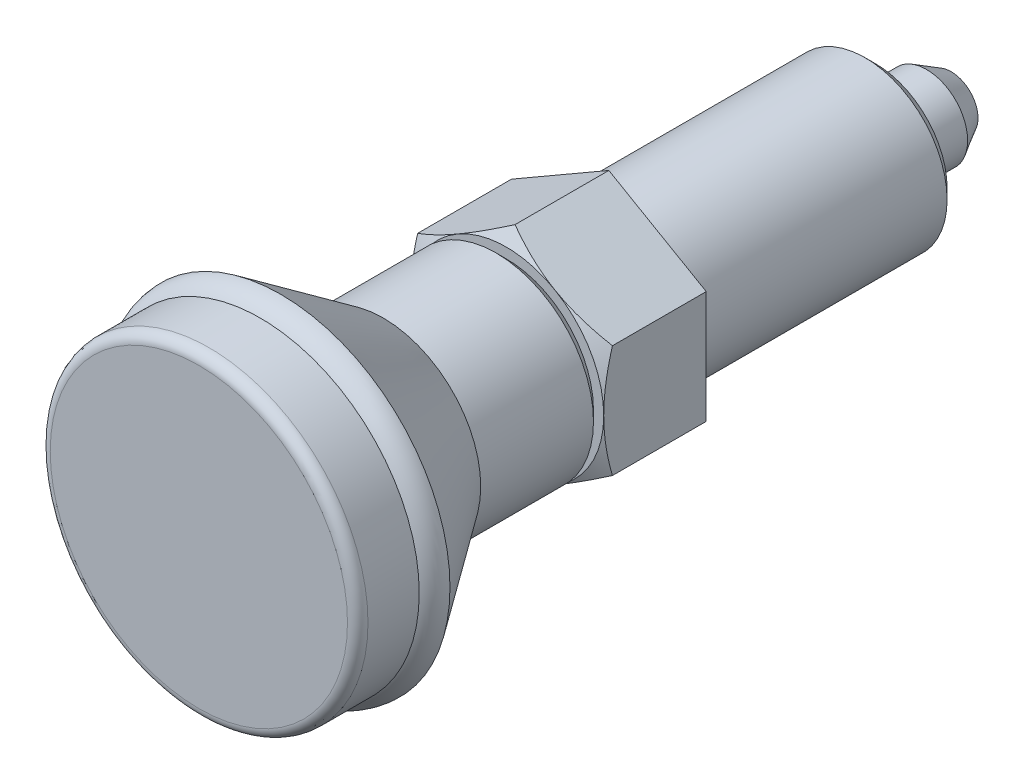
ISO-10303-21;
HEADER;
FILE_DESCRIPTION(('STEP AP214'),'2;1');
FILE_NAME('part.step','',(''),(''),'','','');
FILE_SCHEMA(('AUTOMOTIVE_DESIGN { 1 0 10303 214 1 1 1 1 }'));
ENDSEC;
DATA;
#1=APPLICATION_CONTEXT('core data for automotive mechanical design processes');
#2=APPLICATION_PROTOCOL_DEFINITION('international standard','automotive_design',2000,#1);
#3=PRODUCT_CONTEXT('',#1,'mechanical');
#4=PRODUCT('Part','Part','',(#3));
#5=PRODUCT_RELATED_PRODUCT_CATEGORY('part','',(#4));
#6=PRODUCT_DEFINITION_FORMATION('','',#4);
#7=PRODUCT_DEFINITION_CONTEXT('part definition',#1,'design');
#8=PRODUCT_DEFINITION('design','',#6,#7);
#9=PRODUCT_DEFINITION_SHAPE('','',#8);
#10=(LENGTH_UNIT() NAMED_UNIT(*) SI_UNIT(.MILLI.,.METRE.));
#11=(NAMED_UNIT(*) PLANE_ANGLE_UNIT() SI_UNIT($,.RADIAN.));
#12=(NAMED_UNIT(*) SI_UNIT($,.STERADIAN.) SOLID_ANGLE_UNIT());
#13=UNCERTAINTY_MEASURE_WITH_UNIT(LENGTH_MEASURE(1.E-05),#10,'distance_accuracy_value','');
#14=(GEOMETRIC_REPRESENTATION_CONTEXT(3) GLOBAL_UNCERTAINTY_ASSIGNED_CONTEXT((#13)) GLOBAL_UNIT_ASSIGNED_CONTEXT((#10,
#11,#12)) REPRESENTATION_CONTEXT('',''));
#15=CARTESIAN_POINT('',(0.,0.,0.));
#16=DIRECTION('',(0.,0.,1.));
#17=DIRECTION('',(1.,0.,0.));
#18=AXIS2_PLACEMENT_3D('',#15,#16,#17);
#19=CARTESIAN_POINT('',(-1.68952183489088E-08,9.75446155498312E-09,10.));
#20=DIRECTION('',(1.68952183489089E-09,-9.75446155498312E-10,-1.));
#21=DIRECTION('',(-1.,0.,-1.68952183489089E-09));
#22=AXIS2_PLACEMENT_3D('',#19,#20,#21);
#23=CONICAL_SURFACE('',#22,9.5,1.0471975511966);
#24=CARTESIAN_POINT('',(9.50019998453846,5.48471209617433,9.15142756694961));
#25=CARTESIAN_POINT('',(9.29136921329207,5.60528059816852,9.22102657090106));
#26=CARTESIAN_POINT('',(9.08175981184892,5.72629864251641,9.28746670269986));
#27=CARTESIAN_POINT('',(8.66086009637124,5.96930520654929,9.41315272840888));
#28=CARTESIAN_POINT('',(8.4495692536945,6.09129403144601,9.47239625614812));
#29=CARTESIAN_POINT('',(7.81229218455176,6.45922611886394,9.63818543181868));
#30=CARTESIAN_POINT('',(7.38379021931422,6.70662184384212,9.73248556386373));
#31=CARTESIAN_POINT('',(6.74255664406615,7.07683822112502,9.84306129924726));
#32=CARTESIAN_POINT('',(6.53174076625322,7.19855282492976,9.87456017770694));
#33=CARTESIAN_POINT('',(6.10913294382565,7.44254556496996,9.92738180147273));
#34=CARTESIAN_POINT('',(5.8973409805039,7.56482371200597,9.94870435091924));
#35=CARTESIAN_POINT('',(5.47340376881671,7.80958397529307,9.98062698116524));
#36=CARTESIAN_POINT('',(5.26125924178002,7.93206567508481,9.99123980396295));
#37=CARTESIAN_POINT('',(4.83677422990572,8.17714221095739,10.0015174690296));
#38=CARTESIAN_POINT('',(4.62443375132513,8.29973704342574,10.0011826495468));
#39=CARTESIAN_POINT('',(4.22745799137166,8.52893110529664,9.9903266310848));
#40=CARTESIAN_POINT('',(4.04279469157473,8.63554651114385,9.9811297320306));
#41=CARTESIAN_POINT('',(3.67389998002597,8.84852797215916,9.95463460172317));
#42=CARTESIAN_POINT('',(3.48966859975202,8.9548940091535,9.93733579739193));
#43=CARTESIAN_POINT('',(2.93768831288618,9.27357997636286,9.87369551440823));
#44=CARTESIAN_POINT('',(2.57091645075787,9.48533580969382,9.81561809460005));
#45=CARTESIAN_POINT('',(1.83348215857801,9.91109369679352,9.67042397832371));
#46=CARTESIAN_POINT('',(1.46291384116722,10.1250414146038,9.58269182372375));
#47=CARTESIAN_POINT('',(0.727303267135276,10.5497463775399,9.3835762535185));
#48=CARTESIAN_POINT('',(0.362251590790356,10.7605090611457,9.27223960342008));
#49=CARTESIAN_POINT('',(-0.000200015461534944,10.9697705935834,9.15142754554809));
#50=B_SPLINE_CURVE_WITH_KNOTS('',3,(#24,#25,#26,#27,#28,#29,#30,#31,#32,#33,#34,#35,#36,#37,#38,
#39,#40,#41,#42,#43,#44,#45,#46,#47,#48,#49),.UNSPECIFIED.,.F.,.F.,(4,2,2,2,2,2,2,2,2,2,2,2,4),
(0.,0.752880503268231,1.50600787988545,3.01546870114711,3.75167336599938,4.48789219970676,
5.22323407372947,5.95855322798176,6.59868084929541,7.23885375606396,8.52010929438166,
9.82978009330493,11.1368800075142),.UNSPECIFIED.);
#51=CARTESIAN_POINT('',(4.74999998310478,8.22724134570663,10.));
#52=VERTEX_POINT('',#51);
#53=CARTESIAN_POINT('',(0.,10.9696551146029,9.15149421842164));
#54=VERTEX_POINT('',#53);
#55=EDGE_CURVE('E99',#52,#54,#50,.T.);
#56=ORIENTED_EDGE('',*,*,#55,.T.);
#57=CARTESIAN_POINT('',(0.000199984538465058,10.9697705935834,9.15142754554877));
#58=CARTESIAN_POINT('',(-0.208630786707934,10.8492020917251,9.22102654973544));
#59=CARTESIAN_POINT('',(-0.418240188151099,10.7281840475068,9.28746668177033));
#60=CARTESIAN_POINT('',(-0.839139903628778,10.4851774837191,9.41315270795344));
#61=CARTESIAN_POINT('',(-1.05043074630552,10.363188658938,9.47239623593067));
#62=CARTESIAN_POINT('',(-1.68770781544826,9.99525657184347,9.63818541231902));
#63=CARTESIAN_POINT('',(-2.11620978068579,9.74786084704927,9.73248554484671));
#64=CARTESIAN_POINT('',(-2.75744335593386,9.37764446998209,9.8430612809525));
#65=CARTESIAN_POINT('',(-2.96825923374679,9.2559298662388,9.87456015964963));
#66=CARTESIAN_POINT('',(-3.39086705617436,9.01193712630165,9.92738178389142));
#67=CARTESIAN_POINT('',(-3.60265901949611,8.88965897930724,9.94870433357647));
#68=CARTESIAN_POINT('',(-4.0265962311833,8.64489871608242,9.98062696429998));
#69=CARTESIAN_POINT('',(-4.23874075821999,8.52241701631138,9.99123978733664));
#70=CARTESIAN_POINT('',(-4.66322577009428,8.27734048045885,10.0015174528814));
#71=CARTESIAN_POINT('',(-4.87556624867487,8.15474564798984,10.0011826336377));
#72=CARTESIAN_POINT('',(-5.27254200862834,7.92555158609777,9.9903266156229));
#73=CARTESIAN_POINT('',(-5.45720530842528,7.81893618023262,9.98112971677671));
#74=CARTESIAN_POINT('',(-5.82610001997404,7.60595471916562,9.95463458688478));
#75=CARTESIAN_POINT('',(-6.010331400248,7.49958868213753,9.93733578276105));
#76=CARTESIAN_POINT('',(-6.56231168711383,7.18090271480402,9.87369550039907));
#77=CARTESIAN_POINT('',(-6.92908354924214,6.96914688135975,9.815618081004));
#78=CARTESIAN_POINT('',(-7.66651784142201,6.54338899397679,9.67042396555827));
#79=CARTESIAN_POINT('',(-8.0370861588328,6.32944127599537,9.58269181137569));
#80=CARTESIAN_POINT('',(-8.77269673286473,5.90473631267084,9.383576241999));
#81=CARTESIAN_POINT('',(-9.13774840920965,5.69397362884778,9.27223959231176));
#82=CARTESIAN_POINT('',(-9.50020001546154,5.48471209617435,9.15142753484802));
#83=B_SPLINE_CURVE_WITH_KNOTS('',3,(#57,#58,#59,#60,#61,#62,#63,#64,#65,#66,#67,#68,#69,#70,#71,
#72,#73,#74,#75,#76,#77,#78,#79,#80,#81,#82),.UNSPECIFIED.,.F.,.F.,(4,2,2,2,2,2,2,2,2,2,2,2,4),
(0.,0.752880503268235,1.50600787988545,3.0154687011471,3.75167336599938,4.48789219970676,
5.22323407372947,5.95855322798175,6.5986808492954,7.23885375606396,8.52010929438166,
9.82978009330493,11.1368800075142),.UNSPECIFIED.);
#84=CARTESIAN_POINT('',(-4.75000001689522,8.22724134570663,9.99999998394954));
#85=VERTEX_POINT('',#84);
#86=EDGE_CURVE('E91',#54,#85,#83,.T.);
#87=ORIENTED_EDGE('',*,*,#86,.T.);
#88=CARTESIAN_POINT('',(-1.68952183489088E-08,9.75446155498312E-09,10.));
#89=DIRECTION('',(-1.68952183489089E-09,9.75446155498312E-10,1.));
#90=DIRECTION('',(1.,0.,1.68952183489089E-09));
#91=AXIS2_PLACEMENT_3D('',#88,#89,#90);
#92=CIRCLE('',#91,9.5);
#93=EDGE_CURVE('E257',#52,#85,#92,.T.);
#94=ORIENTED_EDGE('',*,*,#93,.F.);
#95=EDGE_LOOP('',(#56,#87,#94));
#96=FACE_BOUND('',#95,.T.);
#97=ADVANCED_FACE('F14',(#96),#23,.T.);
#98=CARTESIAN_POINT('',(-9.50000001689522,9.75446153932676E-09,9.99999998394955));
#99=VERTEX_POINT('',#98);
#100=EDGE_CURVE('E263',#85,#99,#92,.T.);
#101=ORIENTED_EDGE('',*,*,#100,.F.);
#102=CARTESIAN_POINT('',(-9.50000001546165,5.48482756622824,9.15149420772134));
#103=VERTEX_POINT('',#102);
#104=EDGE_CURVE('E177',#85,#103,#83,.T.);
#105=ORIENTED_EDGE('',*,*,#104,.T.);
#106=CARTESIAN_POINT('',(-9.50000000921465,-14.5465709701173,5.45399629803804));
#107=CARTESIAN_POINT('',(-9.50000000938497,-14.3380268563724,5.55480343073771));
#108=CARTESIAN_POINT('',(-9.5000000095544,-14.1292306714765,5.65508884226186));
#109=CARTESIAN_POINT('',(-9.5000000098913,-13.7110809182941,5.85449646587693));
#110=CARTESIAN_POINT('',(-9.50000001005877,-13.5017273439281,5.95361866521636));
#111=CARTESIAN_POINT('',(-9.50000001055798,-12.8726893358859,6.24908954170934));
#112=CARTESIAN_POINT('',(-9.50000001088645,-12.452095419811,6.44350962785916));
#113=CARTESIAN_POINT('',(-9.50000001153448,-11.6055942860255,6.82706422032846));
#114=CARTESIAN_POINT('',(-9.50000001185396,-11.1796704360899,7.01616211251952));
#115=CARTESIAN_POINT('',(-9.50000001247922,-10.3243227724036,7.38623889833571));
#116=CARTESIAN_POINT('',(-9.50000001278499,-9.89489914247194,7.56721821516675));
#117=CARTESIAN_POINT('',(-9.50000001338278,-9.02653674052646,7.92104244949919));
#118=CARTESIAN_POINT('',(-9.50000001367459,-8.58754587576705,8.0937602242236));
#119=CARTESIAN_POINT('',(-9.50000001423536,-7.70438742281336,8.42566891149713));
#120=CARTESIAN_POINT('',(-9.50000001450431,-7.26021926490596,8.58485831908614));
#121=CARTESIAN_POINT('',(-9.50000001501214,-6.36690630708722,8.88543196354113));
#122=CARTESIAN_POINT('',(-9.50000001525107,-5.91777438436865,9.02685405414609));
#123=CARTESIAN_POINT('',(-9.50000001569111,-5.01314168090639,9.28730254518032));
#124=CARTESIAN_POINT('',(-9.50000001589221,-4.55764296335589,9.40633602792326));
#125=CARTESIAN_POINT('',(-9.50000001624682,-3.6398894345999,9.61621986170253));
#126=CARTESIAN_POINT('',(-9.5000000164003,-3.17763285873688,9.70706270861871));
#127=CARTESIAN_POINT('',(-9.50000001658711,-2.48018031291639,9.81763542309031));
#128=CARTESIAN_POINT('',(-9.50000001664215,-2.24698957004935,9.85021346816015));
#129=CARTESIAN_POINT('',(-9.50000001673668,-1.77951478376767,9.90616470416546));
#130=CARTESIAN_POINT('',(-9.50000001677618,-1.54523085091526,9.9295388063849));
#131=CARTESIAN_POINT('',(-9.50000001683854,-1.07737257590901,9.96645312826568));
#132=CARTESIAN_POINT('',(-9.50000001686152,-0.843803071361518,9.98005441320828));
#133=CARTESIAN_POINT('',(-9.50000001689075,-0.376297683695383,9.99735119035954));
#134=CARTESIAN_POINT('',(-9.50000001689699,-0.142361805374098,10.0010468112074));
#135=CARTESIAN_POINT('',(-9.50000001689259,0.325389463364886,9.99844420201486));
#136=CARTESIAN_POINT('',(-9.50000001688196,0.559204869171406,9.99214877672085));
#137=CARTESIAN_POINT('',(-9.50000001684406,1.02636654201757,9.96972062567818));
#138=CARTESIAN_POINT('',(-9.5000000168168,1.25971278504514,9.95358740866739));
#139=CARTESIAN_POINT('',(-9.50000001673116,1.82527223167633,9.90289986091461));
#140=CARTESIAN_POINT('',(-9.50000001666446,2.15705090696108,9.86341644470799));
#141=CARTESIAN_POINT('',(-9.50000001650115,2.81806586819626,9.76675324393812));
#142=CARTESIAN_POINT('',(-9.50000001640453,3.14730143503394,9.70956862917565));
#143=CARTESIAN_POINT('',(-9.50000001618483,3.80295856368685,9.57953118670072));
#144=CARTESIAN_POINT('',(-9.50000001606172,4.12937715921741,9.50666354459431));
#145=CARTESIAN_POINT('',(-9.50000001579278,4.77885596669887,9.34748332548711));
#146=CARTESIAN_POINT('',(-9.50000001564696,5.10191649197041,9.2611720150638));
#147=CARTESIAN_POINT('',(-9.50000001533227,5.75263606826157,9.0749131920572));
#148=CARTESIAN_POINT('',(-9.50000001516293,6.08021372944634,8.9746832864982));
#149=CARTESIAN_POINT('',(-9.50000001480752,6.73190654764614,8.7643201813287));
#150=CARTESIAN_POINT('',(-9.50000001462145,7.0560239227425,8.65419381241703));
#151=CARTESIAN_POINT('',(-9.50000001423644,7.69949560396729,8.42631254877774));
#152=CARTESIAN_POINT('',(-9.50000001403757,8.01886645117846,8.30860408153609));
#153=CARTESIAN_POINT('',(-9.50000001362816,8.65513027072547,8.06627833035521));
#154=CARTESIAN_POINT('',(-9.50000001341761,8.97202218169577,7.94165825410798));
#155=CARTESIAN_POINT('',(-9.50000001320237,9.28776285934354,7.81426608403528));
#156=B_SPLINE_CURVE_WITH_KNOTS('',3,(#106,#107,#108,#109,#110,#111,#112,#113,#114,#115,#116,
#117,#118,#119,#120,#121,#122,#123,#124,#125,#126,#127,#128,#129,#130,#131,#132,#133,#134,#135,
#136,#137,#138,#139,#140,#141,#142,#143,#144,#145,#146,#147,#148,#149,#150,#151,#152,#153,#154,
#155),.UNSPECIFIED.,.F.,.F.,(4,2,2,2,2,2,2,2,2,2,2,2,2,2,2,2,2,2,2,2,2,2,2,2,4),(0.,
0.694890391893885,1.3897883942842,2.7798104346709,4.1777870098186,5.57569062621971,
6.99075616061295,8.4059789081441,9.81813342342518,11.2298404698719,12.6419229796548,
13.348136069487,14.054279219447,14.7559707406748,15.4576531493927,16.1591386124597,
16.8606591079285,17.8624602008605,18.8645349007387,19.8675603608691,20.8704913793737,
21.8980064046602,22.9248175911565,23.9458491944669,24.9672963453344),.UNSPECIFIED.);
#157=EDGE_CURVE('E176',#103,#99,#156,.F.);
#158=ORIENTED_EDGE('',*,*,#157,.T.);
#159=EDGE_LOOP('',(#101,#105,#158));
#160=FACE_BOUND('',#159,.T.);
#161=ADVANCED_FACE('F226',(#160),#23,.T.);
#162=CARTESIAN_POINT('',(-4.75000001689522,-8.22724132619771,10.));
#163=VERTEX_POINT('',#162);
#164=EDGE_CURVE('E269',#99,#163,#92,.T.);
#165=ORIENTED_EDGE('',*,*,#164,.F.);
#166=CARTESIAN_POINT('',(-9.50000001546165,-5.48482754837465,9.15149421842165));
#167=VERTEX_POINT('',#166);
#168=EDGE_CURVE('E169',#99,#167,#156,.F.);
#169=ORIENTED_EDGE('',*,*,#168,.T.);
#170=CARTESIAN_POINT('',(-9.50020001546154,-5.48471207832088,9.1514275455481));
#171=CARTESIAN_POINT('',(-9.29136924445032,-5.60528058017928,9.22102655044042));
#172=CARTESIAN_POINT('',(-9.08175984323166,-5.72629862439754,9.2874666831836));
#173=CARTESIAN_POINT('',(-8.66086012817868,-5.96930518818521,9.41315271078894));
#174=CARTESIAN_POINT('',(-8.44956928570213,-6.09129401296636,9.47239623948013));
#175=CARTESIAN_POINT('',(-7.8122922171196,-6.45922610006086,9.63818541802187));
#176=CARTESIAN_POINT('',(-7.38379025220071,-6.70662182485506,9.73248555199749));
#177=CARTESIAN_POINT('',(-6.74255667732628,-7.07683820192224,9.84306129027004));
#178=CARTESIAN_POINT('',(-6.53174079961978,-7.19855280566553,9.87456016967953));
#179=CARTESIAN_POINT('',(-6.10913297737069,-7.44254554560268,9.92738179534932));
#180=CARTESIAN_POINT('',(-5.89734101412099,-7.5648236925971,9.94870434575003));
#181=CARTESIAN_POINT('',(-5.47340380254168,-7.80958395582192,9.98062697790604));
#182=CARTESIAN_POINT('',(-5.26125927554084,-7.93206565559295,9.99123980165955));
#183=CARTESIAN_POINT('',(-4.83677426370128,-8.17714219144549,10.0015174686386));
#184=CARTESIAN_POINT('',(-4.62443378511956,-8.2997370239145,10.0011826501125));
#185=CARTESIAN_POINT('',(-4.22745802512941,-8.52893108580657,9.99032663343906));
#186=CARTESIAN_POINT('',(-4.04279472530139,-8.63554649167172,9.98112973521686));
#187=CARTESIAN_POINT('',(-3.67390001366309,-8.84852795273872,9.95463460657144));
#188=CARTESIAN_POINT('',(-3.48966863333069,-8.95489398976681,9.93733580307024));
#189=CARTESIAN_POINT('',(-2.93768834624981,-9.27357995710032,9.87369552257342));
#190=CARTESIAN_POINT('',(-2.57091648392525,-9.48533579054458,9.81561810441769));
#191=CARTESIAN_POINT('',(-1.83348219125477,-9.91109367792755,9.67042399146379));
#192=CARTESIAN_POINT('',(-1.46291387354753,-10.125041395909,9.58269183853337));
#193=CARTESIAN_POINT('',(-0.727303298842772,-10.5497463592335,9.38357627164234));
#194=CARTESIAN_POINT('',(-0.362251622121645,-10.7605090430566,9.27223962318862));
#195=CARTESIAN_POINT('',(0.000199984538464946,-10.96977057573,9.15142756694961));
#196=B_SPLINE_CURVE_WITH_KNOTS('',3,(#170,#171,#172,#173,#174,#175,#176,#177,#178,#179,#180,
#181,#182,#183,#184,#185,#186,#187,#188,#189,#190,#191,#192,#193,#194,#195),.UNSPECIFIED.,.F.,
.F.,(4,2,2,2,2,2,2,2,2,2,2,2,4),(0.,0.752880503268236,1.50600787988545,3.01546870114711,
3.75167336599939,4.48789219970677,5.22323407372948,5.95855322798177,6.59868084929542,
7.23885375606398,8.52010929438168,9.82978009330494,11.1368800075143),.UNSPECIFIED.);
#197=EDGE_CURVE('E168',#167,#163,#196,.T.);
#198=ORIENTED_EDGE('',*,*,#197,.T.);
#199=EDGE_LOOP('',(#165,#169,#198));
#200=FACE_BOUND('',#199,.T.);
#201=ADVANCED_FACE('F233',(#200),#23,.T.);
#202=CARTESIAN_POINT('',(4.74999998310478,-8.22724132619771,10.0000000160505));
#203=VERTEX_POINT('',#202);
#204=EDGE_CURVE('E265',#163,#203,#92,.T.);
#205=ORIENTED_EDGE('',*,*,#204,.F.);
#206=CARTESIAN_POINT('',(-1.54616479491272E-08,-10.9696551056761,9.15149423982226));
#207=VERTEX_POINT('',#206);
#208=EDGE_CURVE('E161',#163,#207,#196,.T.);
#209=ORIENTED_EDGE('',*,*,#208,.T.);
#210=CARTESIAN_POINT('',(-0.000200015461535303,-10.96977057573,9.15142756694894));
#211=CARTESIAN_POINT('',(0.208630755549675,-10.8492020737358,9.22102657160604));
#212=CARTESIAN_POINT('',(0.418240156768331,-10.7281840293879,9.28746670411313));
#213=CARTESIAN_POINT('',(0.83913987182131,-10.485177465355,9.41315273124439));
#214=CARTESIAN_POINT('',(1.05043071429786,-10.3631886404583,9.47239625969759));
#215=CARTESIAN_POINT('',(1.6877077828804,-9.99525655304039,9.63818543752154));
#216=CARTESIAN_POINT('',(2.11620974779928,-9.74786082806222,9.73248557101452));
#217=CARTESIAN_POINT('',(2.75744332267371,-9.37764445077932,9.84306130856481));
#218=CARTESIAN_POINT('',(2.96825920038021,-9.25592984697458,9.87456018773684));
#219=CARTESIAN_POINT('',(3.3908670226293,-9.01193710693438,9.92738181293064));
#220=CARTESIAN_POINT('',(3.602658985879,-8.88965895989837,9.9487043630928));
#221=CARTESIAN_POINT('',(4.02659619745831,-8.64489869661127,9.9806269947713));
#222=CARTESIAN_POINT('',(4.23874072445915,-8.52241699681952,9.99123981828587));
#223=CARTESIAN_POINT('',(4.66322573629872,-8.27734046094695,10.0015174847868));
#224=CARTESIAN_POINT('',(4.87556621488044,-8.1547456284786,10.0011826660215));
#225=CARTESIAN_POINT('',(5.27254197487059,-7.9255515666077,9.99032664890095));
#226=CARTESIAN_POINT('',(5.45720527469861,-7.81893616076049,9.98112975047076));
#227=CARTESIAN_POINT('',(5.82609998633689,-7.60595469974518,9.95463462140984));
#228=CARTESIAN_POINT('',(6.0103313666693,-7.49958866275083,9.93733581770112));
#229=CARTESIAN_POINT('',(6.56231165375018,-7.18090269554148,9.87369553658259));
#230=CARTESIAN_POINT('',(6.92908351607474,-6.96914686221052,9.81561811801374));
#231=CARTESIAN_POINT('',(7.66651780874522,-6.54338897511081,9.67042400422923));
#232=CARTESIAN_POINT('',(8.03708612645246,-6.32944125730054,9.58269185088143));
#233=CARTESIAN_POINT('',(8.77269670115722,-5.90473629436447,9.38357628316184));
#234=CARTESIAN_POINT('',(9.13774837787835,-5.69397361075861,9.27223963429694));
#235=CARTESIAN_POINT('',(9.50019998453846,-5.48471207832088,9.15142757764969));
#236=B_SPLINE_CURVE_WITH_KNOTS('',3,(#210,#211,#212,#213,#214,#215,#216,#217,#218,#219,#220,
#221,#222,#223,#224,#225,#226,#227,#228,#229,#230,#231,#232,#233,#234,#235),.UNSPECIFIED.,.F.,
.F.,(4,2,2,2,2,2,2,2,2,2,2,2,4),(0.,0.752880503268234,1.50600787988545,3.01546870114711,
3.75167336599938,4.48789219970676,5.22323407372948,5.95855322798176,6.59868084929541,
7.23885375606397,8.52010929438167,9.82978009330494,11.1368800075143),.UNSPECIFIED.);
#237=EDGE_CURVE('E159',#207,#203,#236,.T.);
#238=ORIENTED_EDGE('',*,*,#237,.T.);
#239=EDGE_LOOP('',(#205,#209,#238));
#240=FACE_BOUND('',#239,.T.);
#241=ADVANCED_FACE('F245',(#240),#23,.T.);
#242=CARTESIAN_POINT('',(9.49999998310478,9.75446006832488E-09,10.0000000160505));
#243=VERTEX_POINT('',#242);
#244=EDGE_CURVE('E259',#203,#243,#92,.T.);
#245=ORIENTED_EDGE('',*,*,#244,.F.);
#246=CARTESIAN_POINT('',(9.49999998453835,-5.48482754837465,9.15149425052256));
#247=VERTEX_POINT('',#246);
#248=EDGE_CURVE('E152',#203,#247,#236,.T.);
#249=ORIENTED_EDGE('',*,*,#248,.T.);
#250=CARTESIAN_POINT('',(9.49999999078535,-14.5465709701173,5.45399633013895));
#251=CARTESIAN_POINT('',(9.49999999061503,-14.3380268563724,5.55480346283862));
#252=CARTESIAN_POINT('',(9.49999999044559,-14.1292306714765,5.65508887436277));
#253=CARTESIAN_POINT('',(9.49999999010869,-13.7110809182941,5.85449649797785));
#254=CARTESIAN_POINT('',(9.49999998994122,-13.5017273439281,5.95361869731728));
#255=CARTESIAN_POINT('',(9.49999998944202,-12.8726893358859,6.24908957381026));
#256=CARTESIAN_POINT('',(9.49999998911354,-12.452095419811,6.44350965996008));
#257=CARTESIAN_POINT('',(9.49999998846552,-11.6055942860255,6.82706425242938));
#258=CARTESIAN_POINT('',(9.49999998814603,-11.1796704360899,7.01616214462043));
#259=CARTESIAN_POINT('',(9.49999998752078,-10.3243227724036,7.38623893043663));
#260=CARTESIAN_POINT('',(9.49999998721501,-9.89489914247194,7.56721824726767));
#261=CARTESIAN_POINT('',(9.49999998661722,-9.02653674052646,7.92104248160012));
#262=CARTESIAN_POINT('',(9.49999998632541,-8.58754587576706,8.09376025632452));
#263=CARTESIAN_POINT('',(9.49999998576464,-7.70438742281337,8.42566894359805));
#264=CARTESIAN_POINT('',(9.49999998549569,-7.26021926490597,8.58485835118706));
#265=CARTESIAN_POINT('',(9.49999998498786,-6.36690630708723,8.88543199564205));
#266=CARTESIAN_POINT('',(9.49999998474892,-5.91777438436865,9.02685408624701));
#267=CARTESIAN_POINT('',(9.49999998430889,-5.01314168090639,9.28730257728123));
#268=CARTESIAN_POINT('',(9.49999998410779,-4.55764296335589,9.40633606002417));
#269=CARTESIAN_POINT('',(9.49999998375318,-3.6398894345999,9.61621989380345));
#270=CARTESIAN_POINT('',(9.4999999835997,-3.17763285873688,9.70706274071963));
#271=CARTESIAN_POINT('',(9.49999998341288,-2.48018031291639,9.81763545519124));
#272=CARTESIAN_POINT('',(9.49999998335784,-2.24698957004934,9.85021350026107));
#273=CARTESIAN_POINT('',(9.49999998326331,-1.77951478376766,9.90616473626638));
#274=CARTESIAN_POINT('',(9.49999998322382,-1.54523085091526,9.92953883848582));
#275=CARTESIAN_POINT('',(9.49999998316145,-1.077372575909,9.9664531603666));
#276=CARTESIAN_POINT('',(9.49999998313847,-0.843803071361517,9.98005444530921));
#277=CARTESIAN_POINT('',(9.49999998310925,-0.376297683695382,9.99735122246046));
#278=CARTESIAN_POINT('',(9.49999998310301,-0.142361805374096,10.0010468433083));
#279=CARTESIAN_POINT('',(9.4999999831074,0.32538946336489,9.99844423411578));
#280=CARTESIAN_POINT('',(9.49999998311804,0.55920486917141,9.99214880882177));
#281=CARTESIAN_POINT('',(9.49999998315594,1.02636654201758,9.9697206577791));
#282=CARTESIAN_POINT('',(9.4999999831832,1.25971278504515,9.95358744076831));
#283=CARTESIAN_POINT('',(9.49999998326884,1.82527223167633,9.90289989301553));
#284=CARTESIAN_POINT('',(9.49999998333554,2.15705090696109,9.86341647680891));
#285=CARTESIAN_POINT('',(9.49999998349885,2.81806586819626,9.76675327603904));
#286=CARTESIAN_POINT('',(9.49999998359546,3.14730143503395,9.70956866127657));
#287=CARTESIAN_POINT('',(9.49999998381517,3.80295856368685,9.57953121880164));
#288=CARTESIAN_POINT('',(9.49999998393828,4.12937715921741,9.50666357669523));
#289=CARTESIAN_POINT('',(9.49999998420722,4.77885596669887,9.34748335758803));
#290=CARTESIAN_POINT('',(9.49999998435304,5.10191649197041,9.26117204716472));
#291=CARTESIAN_POINT('',(9.49999998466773,5.75263606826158,9.07491322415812));
#292=CARTESIAN_POINT('',(9.49999998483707,6.08021372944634,8.97468331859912));
#293=CARTESIAN_POINT('',(9.49999998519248,6.73190654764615,8.76432021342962));
#294=CARTESIAN_POINT('',(9.49999998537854,7.05602392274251,8.65419384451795));
#295=CARTESIAN_POINT('',(9.49999998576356,7.69949560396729,8.42631258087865));
#296=CARTESIAN_POINT('',(9.49999998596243,8.01886645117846,8.30860411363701));
#297=CARTESIAN_POINT('',(9.49999998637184,8.65513027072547,8.06627836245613));
#298=CARTESIAN_POINT('',(9.49999998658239,8.97202218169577,7.9416582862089));
#299=CARTESIAN_POINT('',(9.49999998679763,9.28776285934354,7.8142661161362));
#300=B_SPLINE_CURVE_WITH_KNOTS('',3,(#250,#251,#252,#253,#254,#255,#256,#257,#258,#259,#260,
#261,#262,#263,#264,#265,#266,#267,#268,#269,#270,#271,#272,#273,#274,#275,#276,#277,#278,#279,
#280,#281,#282,#283,#284,#285,#286,#287,#288,#289,#290,#291,#292,#293,#294,#295,#296,#297,#298,
#299),.UNSPECIFIED.,.F.,.F.,(4,2,2,2,2,2,2,2,2,2,2,2,2,2,2,2,2,2,2,2,2,2,2,2,4),(0.,
0.694890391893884,1.3897883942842,2.7798104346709,4.1777870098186,5.57569062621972,
6.99075616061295,8.4059789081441,9.81813342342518,11.2298404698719,12.6419229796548,
13.348136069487,14.054279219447,14.7559707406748,15.4576531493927,16.1591386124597,
16.8606591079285,17.8624602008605,18.8645349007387,19.8675603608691,20.8704913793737,
21.8980064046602,22.9248175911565,23.9458491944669,24.9672963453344),.UNSPECIFIED.);
#301=EDGE_CURVE('E160',#247,#243,#300,.T.);
#302=ORIENTED_EDGE('',*,*,#301,.T.);
#303=EDGE_LOOP('',(#245,#249,#302));
#304=FACE_BOUND('',#303,.T.);
#305=ADVANCED_FACE('F236',(#304),#23,.T.);
#306=EDGE_CURVE('E251',#243,#52,#92,.T.);
#307=ORIENTED_EDGE('',*,*,#306,.F.);
#308=CARTESIAN_POINT('',(9.49999998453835,5.48482756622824,9.15149423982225));
#309=VERTEX_POINT('',#308);
#310=EDGE_CURVE('E127',#243,#309,#300,.T.);
#311=ORIENTED_EDGE('',*,*,#310,.T.);
#312=EDGE_CURVE('E126',#309,#52,#50,.T.);
#313=ORIENTED_EDGE('',*,*,#312,.T.);
#314=EDGE_LOOP('',(#307,#311,#313));
#315=FACE_BOUND('',#314,.T.);
#316=ADVANCED_FACE('F228',(#315),#23,.T.);
#317=CARTESIAN_POINT('',(-6.58913515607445E-08,3.80424000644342E-08,39.));
#318=DIRECTION('',(-1.68952183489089E-09,9.75446155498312E-10,1.));
#319=DIRECTION('',(1.,0.,1.68952183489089E-09));
#320=AXIS2_PLACEMENT_3D('',#317,#318,#319);
#321=TOROIDAL_SURFACE('',#320,14.5,1.);
#322=CARTESIAN_POINT('',(-6.58913515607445E-08,3.80424000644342E-08,39.));
#323=DIRECTION('',(-1.68952183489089E-09,9.75446155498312E-10,1.));
#324=DIRECTION('',(1.,0.,1.68952183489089E-09));
#325=AXIS2_PLACEMENT_3D('',#322,#323,#324);
#326=CIRCLE('',#325,15.5);
#327=CARTESIAN_POINT('',(15.4999999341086,3.80424000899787E-08,39.0000000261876));
#328=VERTEX_POINT('',#327);
#329=EDGE_CURVE('E9',#328,#328,#326,.T.);
#330=ORIENTED_EDGE('',*,*,#329,.T.);
#331=EDGE_LOOP('',(#330));
#332=FACE_BOUND('',#331,.T.);
#333=CARTESIAN_POINT('',(-6.75808733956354E-08,3.90178462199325E-08,40.));
#334=DIRECTION('',(-1.68952183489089E-09,9.75446155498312E-10,1.));
#335=DIRECTION('',(1.,0.,1.68952183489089E-09));
#336=AXIS2_PLACEMENT_3D('',#333,#334,#335);
#337=CIRCLE('',#336,14.5);
#338=CARTESIAN_POINT('',(14.4999999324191,3.9017846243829E-08,40.0000000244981));
#339=VERTEX_POINT('',#338);
#340=EDGE_CURVE('E286',#339,#339,#337,.T.);
#341=ORIENTED_EDGE('',*,*,#340,.F.);
#342=EDGE_LOOP('',(#341));
#343=FACE_BOUND('',#342,.T.);
#344=ADVANCED_FACE('F16',(#332,#343),#321,.T.);
#345=CARTESIAN_POINT('',(-6.75808733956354E-08,3.90178462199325E-08,40.));
#346=DIRECTION('',(-1.68952183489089E-09,9.75446155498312E-10,1.));
#347=DIRECTION('',(1.,0.,1.68952183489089E-09));
#348=AXIS2_PLACEMENT_3D('',#345,#346,#347);
#349=CYLINDRICAL_SURFACE('',#348,15.5);
#350=CARTESIAN_POINT('',(-5.74437423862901E-08,3.31651692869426E-08,34.));
#351=DIRECTION('',(-1.68952183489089E-09,9.75446155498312E-10,1.));
#352=DIRECTION('',(1.,0.,1.68952183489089E-09));
#353=AXIS2_PLACEMENT_3D('',#350,#351,#352);
#354=CIRCLE('',#353,15.5);
#355=CARTESIAN_POINT('',(15.4999999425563,3.31651693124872E-08,34.0000000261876));
#356=VERTEX_POINT('',#355);
#357=EDGE_CURVE('E22',#356,#356,#354,.T.);
#358=ORIENTED_EDGE('',*,*,#357,.T.);
#359=EDGE_LOOP('',(#358));
#360=FACE_BOUND('',#359,.T.);
#361=ORIENTED_EDGE('',*,*,#329,.F.);
#362=EDGE_LOOP('',(#361));
#363=FACE_BOUND('',#362,.T.);
#364=ADVANCED_FACE('F243',(#360,#363),#349,.T.);
#365=CARTESIAN_POINT('',(-5.40646987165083E-08,3.1214276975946E-08,32.));
#366=DIRECTION('',(-1.68952183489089E-09,9.75446155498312E-10,1.));
#367=DIRECTION('',(1.,0.,1.68952183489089E-09));
#368=AXIS2_PLACEMENT_3D('',#365,#366,#367);
#369=TOROIDAL_SURFACE('',#368,14.0000000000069,2.49999999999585);
#370=CARTESIAN_POINT('',(-5.40646987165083E-08,3.1214276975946E-08,32.));
#371=DIRECTION('',(-1.68952183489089E-09,9.75446155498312E-10,1.));
#372=DIRECTION('',(1.,0.,1.68952183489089E-09));
#373=AXIS2_PLACEMENT_3D('',#370,#371,#372);
#374=CIRCLE('',#373,16.5000000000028);
#375=CARTESIAN_POINT('',(16.4999999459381,3.12142770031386E-08,32.0000000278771));
#376=VERTEX_POINT('',#375);
#377=EDGE_CURVE('E500',#376,#376,#374,.T.);
#378=ORIENTED_EDGE('',*,*,#377,.T.);
#379=EDGE_LOOP('',(#378));
#380=FACE_BOUND('',#379,.T.);
#381=ORIENTED_EDGE('',*,*,#357,.F.);
#382=EDGE_LOOP('',(#381));
#383=FACE_BOUND('',#382,.T.);
#384=ADVANCED_FACE('F419',(#380,#383),#369,.T.);
#385=CARTESIAN_POINT('',(-5.40646987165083E-08,3.1214276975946E-08,32.));
#386=DIRECTION('',(-1.68952183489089E-09,9.75446155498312E-10,1.));
#387=DIRECTION('',(1.,0.,1.68952183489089E-09));
#388=AXIS2_PLACEMENT_3D('',#385,#386,#387);
#389=CONICAL_SURFACE('',#388,16.5000000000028,0.610725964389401);
#390=CARTESIAN_POINT('',(-3.71694803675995E-08,2.14598154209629E-08,22.));
#391=DIRECTION('',(-1.68952183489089E-09,9.75446155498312E-10,1.));
#392=DIRECTION('',(1.,0.,1.68952183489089E-09));
#393=AXIS2_PLACEMENT_3D('',#390,#391,#392);
#394=CIRCLE('',#393,9.5);
#395=CARTESIAN_POINT('',(9.49999996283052,2.14598154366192E-08,22.0000000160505));
#396=VERTEX_POINT('',#395);
#397=EDGE_CURVE('E497',#396,#396,#394,.T.);
#398=ORIENTED_EDGE('',*,*,#397,.T.);
#399=EDGE_LOOP('',(#398));
#400=FACE_BOUND('',#399,.T.);
#401=ORIENTED_EDGE('',*,*,#377,.F.);
#402=EDGE_LOOP('',(#401));
#403=FACE_BOUND('',#402,.T.);
#404=ADVANCED_FACE('F428',(#400,#403),#389,.T.);
#405=CARTESIAN_POINT('',(-6.75808733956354E-08,3.90178462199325E-08,40.));
#406=DIRECTION('',(-1.68952183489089E-09,9.75446155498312E-10,1.));
#407=DIRECTION('',(1.,0.,1.68952183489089E-09));
#408=AXIS2_PLACEMENT_3D('',#405,#406,#407);
#409=CYLINDRICAL_SURFACE('',#408,9.5);
#410=CARTESIAN_POINT('',(-1.85847401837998E-08,1.07299077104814E-08,11.));
#411=DIRECTION('',(-1.68952183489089E-09,9.75446155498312E-10,1.));
#412=DIRECTION('',(1.,0.,1.68952183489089E-09));
#413=AXIS2_PLACEMENT_3D('',#410,#411,#412);
#414=CIRCLE('',#413,9.5);
#415=CARTESIAN_POINT('',(9.49999998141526,1.07299077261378E-08,11.0000000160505));
#416=VERTEX_POINT('',#415);
#417=EDGE_CURVE('E261',#416,#416,#414,.T.);
#418=ORIENTED_EDGE('',*,*,#417,.T.);
#419=EDGE_LOOP('',(#418));
#420=FACE_BOUND('',#419,.T.);
#421=ORIENTED_EDGE('',*,*,#397,.F.);
#422=EDGE_LOOP('',(#421));
#423=FACE_BOUND('',#422,.T.);
#424=ADVANCED_FACE('F438',(#420,#423),#409,.T.);
#425=CARTESIAN_POINT('',(-1.85847401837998E-08,1.07299077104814E-08,11.));
#426=DIRECTION('',(-1.68952183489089E-09,9.75446155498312E-10,1.));
#427=DIRECTION('',(1.,0.,1.68952183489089E-09));
#428=AXIS2_PLACEMENT_3D('',#425,#426,#427);
#429=CONICAL_SURFACE('',#428,9.5,0.785398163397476);
#430=CARTESIAN_POINT('',(-1.68952183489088E-08,9.75446155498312E-09,10.));
#431=DIRECTION('',(-1.68952183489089E-09,9.75446155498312E-10,1.));
#432=DIRECTION('',(1.,0.,1.68952183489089E-09));
#433=AXIS2_PLACEMENT_3D('',#430,#431,#432);
#434=CIRCLE('',#433,8.49999999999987);
#435=CARTESIAN_POINT('',(8.49999998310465,9.75446156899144E-09,10.0000000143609));
#436=VERTEX_POINT('',#435);
#437=EDGE_CURVE('E256',#436,#436,#434,.T.);
#438=ORIENTED_EDGE('',*,*,#437,.T.);
#439=EDGE_LOOP('',(#438));
#440=FACE_BOUND('',#439,.T.);
#441=ORIENTED_EDGE('',*,*,#417,.F.);
#442=EDGE_LOOP('',(#441));
#443=FACE_BOUND('',#442,.T.);
#444=ADVANCED_FACE('F448',(#440,#443),#429,.T.);
#445=CARTESIAN_POINT('',(-1.68952183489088E-08,8.50000000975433,9.99999999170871));
#446=DIRECTION('',(-1.68952183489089E-09,9.75446155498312E-10,1.));
#447=DIRECTION('',(1.,0.,1.68952183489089E-09));
#448=AXIS2_PLACEMENT_3D('',#445,#446,#447);
#449=PLANE('',#448);
#450=ORIENTED_EDGE('',*,*,#306,.T.);
#451=ORIENTED_EDGE('',*,*,#93,.T.);
#452=ORIENTED_EDGE('',*,*,#100,.T.);
#453=ORIENTED_EDGE('',*,*,#164,.T.);
#454=ORIENTED_EDGE('',*,*,#204,.T.);
#455=ORIENTED_EDGE('',*,*,#244,.T.);
#456=EDGE_LOOP('',(#450,#451,#452,#453,#454,#455));
#457=FACE_BOUND('',#456,.T.);
#458=ORIENTED_EDGE('',*,*,#437,.F.);
#459=EDGE_LOOP('',(#458));
#460=FACE_BOUND('',#459,.T.);
#461=ADVANCED_FACE('F194',(#457,#460),#449,.T.);
#462=CARTESIAN_POINT('',(-6.75808733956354E-08,3.90178462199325E-08,40.));
#463=DIRECTION('',(-1.68952183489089E-09,9.75446155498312E-10,1.));
#464=DIRECTION('',(1.,0.,1.68952183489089E-09));
#465=AXIS2_PLACEMENT_3D('',#462,#463,#464);
#466=PLANE('',#465);
#467=ORIENTED_EDGE('',*,*,#340,.T.);
#468=EDGE_LOOP('',(#467));
#469=FACE_BOUND('',#468,.T.);
#470=ADVANCED_FACE('F191',(#469),#466,.T.);
#471=CARTESIAN_POINT('',(-9.50000006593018,5.48482759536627,39.0229793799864));
#472=DIRECTION('',(-0.5,0.866025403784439,-1.68952206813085E-09));
#473=DIRECTION('',(-0.866025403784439,-0.5,-9.75445751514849E-10));
#474=AXIS2_PLACEMENT_3D('',#471,#472,#473);
#475=PLANE('',#474);
#476=DIRECTION('',(1.68952183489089E-09,-9.75446155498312E-10,-1.));
#477=VECTOR('',#476,1.);
#478=CARTESIAN_POINT('',(-6.59301740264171E-08,10.9696551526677,39.0229793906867));
#479=LINE('',#478,#477);
#480=CARTESIAN_POINT('',(0.,10.9696551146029,-1.07003086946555E-08));
#481=VERTEX_POINT('',#480);
#482=EDGE_CURVE('E29',#54,#481,#479,.T.);
#483=ORIENTED_EDGE('',*,*,#482,.T.);
#484=DIRECTION('',(0.866025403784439,0.5,9.75445751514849E-10));
#485=VECTOR('',#484,1.);
#486=CARTESIAN_POINT('',(-9.5,5.48482755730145,-2.14006104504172E-08));
#487=LINE('',#486,#485);
#488=CARTESIAN_POINT('',(-9.5,5.48482755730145,-2.14006104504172E-08));
#489=VERTEX_POINT('',#488);
#490=EDGE_CURVE('E88',#489,#481,#487,.T.);
#491=ORIENTED_EDGE('',*,*,#490,.F.);
#492=DIRECTION('',(1.68952183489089E-09,-9.75446155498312E-10,-1.));
#493=VECTOR('',#492,1.);
#494=CARTESIAN_POINT('',(-9.50000006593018,5.48482759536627,39.0229793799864));
#495=LINE('',#494,#493);
#496=EDGE_CURVE('E106',#103,#489,#495,.T.);
#497=ORIENTED_EDGE('',*,*,#496,.F.);
#498=ORIENTED_EDGE('',*,*,#104,.F.);
#499=ORIENTED_EDGE('',*,*,#86,.F.);
#500=EDGE_LOOP('',(#483,#491,#497,#498,#499));
#501=FACE_BOUND('',#500,.T.);
#502=ADVANCED_FACE('F85',(#501),#475,.T.);
#503=CARTESIAN_POINT('',(-9.50000006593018,-5.48482751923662,39.0229793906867));
#504=DIRECTION('',(-1.,0.,-1.68952183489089E-09));
#505=DIRECTION('',(-1.68952183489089E-09,9.75446155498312E-10,1.));
#506=AXIS2_PLACEMENT_3D('',#503,#504,#505);
#507=PLANE('',#506);
#508=ORIENTED_EDGE('',*,*,#496,.T.);
#509=DIRECTION('',(0.,1.,-9.75446155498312E-10));
#510=VECTOR('',#509,1.);
#511=CARTESIAN_POINT('',(-9.5,-5.48482755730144,-1.07003017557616E-08));
#512=LINE('',#511,#510);
#513=CARTESIAN_POINT('',(-9.5,-5.48482755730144,-1.07003017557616E-08));
#514=VERTEX_POINT('',#513);
#515=EDGE_CURVE('E104',#514,#489,#512,.T.);
#516=ORIENTED_EDGE('',*,*,#515,.F.);
#517=DIRECTION('',(1.68952183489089E-09,-9.75446155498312E-10,-1.));
#518=VECTOR('',#517,1.);
#519=CARTESIAN_POINT('',(-9.50000006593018,-5.48482751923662,39.0229793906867));
#520=LINE('',#519,#518);
#521=EDGE_CURVE('E105',#167,#514,#520,.T.);
#522=ORIENTED_EDGE('',*,*,#521,.F.);
#523=ORIENTED_EDGE('',*,*,#168,.F.);
#524=ORIENTED_EDGE('',*,*,#157,.F.);
#525=EDGE_LOOP('',(#508,#516,#522,#523,#524));
#526=FACE_BOUND('',#525,.T.);
#527=ADVANCED_FACE('F184',(#526),#507,.T.);
#528=CARTESIAN_POINT('',(-6.59301743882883E-08,-10.9696550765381,39.0229794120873));
#529=DIRECTION('',(-0.5,-0.866025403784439,0.));
#530=DIRECTION('',(0.866025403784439,-0.5,1.95089190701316E-09));
#531=AXIS2_PLACEMENT_3D('',#528,#529,#530);
#532=PLANE('',#531);
#533=ORIENTED_EDGE('',*,*,#521,.T.);
#534=DIRECTION('',(-0.866025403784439,0.5,-1.95089190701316E-09));
#535=VECTOR('',#534,1.);
#536=CARTESIAN_POINT('',(0.,-10.9696551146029,1.07003086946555E-08));
#537=LINE('',#536,#535);
#538=CARTESIAN_POINT('',(0.,-10.9696551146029,1.07003086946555E-08));
#539=VERTEX_POINT('',#538);
#540=EDGE_CURVE('E114',#539,#514,#537,.T.);
#541=ORIENTED_EDGE('',*,*,#540,.F.);
#542=DIRECTION('',(1.68952183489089E-09,-9.75446155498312E-10,-1.));
#543=VECTOR('',#542,1.);
#544=CARTESIAN_POINT('',(-6.59301743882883E-08,-10.9696550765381,39.0229794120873));
#545=LINE('',#544,#543);
#546=EDGE_CURVE('E112',#207,#539,#545,.T.);
#547=ORIENTED_EDGE('',*,*,#546,.F.);
#548=ORIENTED_EDGE('',*,*,#208,.F.);
#549=ORIENTED_EDGE('',*,*,#197,.F.);
#550=EDGE_LOOP('',(#533,#541,#547,#548,#549));
#551=FACE_BOUND('',#550,.T.);
#552=ADVANCED_FACE('F148',(#551),#532,.T.);
#553=CARTESIAN_POINT('',(9.49999993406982,-5.48482751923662,39.0229794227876));
#554=DIRECTION('',(0.5,-0.866025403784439,1.68952206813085E-09));
#555=DIRECTION('',(0.866025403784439,0.5,9.75445751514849E-10));
#556=AXIS2_PLACEMENT_3D('',#553,#554,#555);
#557=PLANE('',#556);
#558=ORIENTED_EDGE('',*,*,#546,.T.);
#559=DIRECTION('',(-0.866025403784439,-0.5,-9.75445751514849E-10));
#560=VECTOR('',#559,1.);
#561=CARTESIAN_POINT('',(9.5,-5.48482755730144,2.14006104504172E-08));
#562=LINE('',#561,#560);
#563=CARTESIAN_POINT('',(9.5,-5.48482755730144,2.14006104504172E-08));
#564=VERTEX_POINT('',#563);
#565=EDGE_CURVE('E117',#564,#539,#562,.T.);
#566=ORIENTED_EDGE('',*,*,#565,.F.);
#567=DIRECTION('',(1.68952183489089E-09,-9.75446155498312E-10,-1.));
#568=VECTOR('',#567,1.);
#569=CARTESIAN_POINT('',(9.49999993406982,-5.48482751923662,39.0229794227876));
#570=LINE('',#569,#568);
#571=EDGE_CURVE('E115',#247,#564,#570,.T.);
#572=ORIENTED_EDGE('',*,*,#571,.F.);
#573=ORIENTED_EDGE('',*,*,#248,.F.);
#574=ORIENTED_EDGE('',*,*,#237,.F.);
#575=EDGE_LOOP('',(#558,#566,#572,#573,#574));
#576=FACE_BOUND('',#575,.T.);
#577=ADVANCED_FACE('F144',(#576),#557,.T.);
#578=CARTESIAN_POINT('',(9.49999993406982,5.48482759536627,39.0229794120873));
#579=DIRECTION('',(1.,0.,1.68952183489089E-09));
#580=DIRECTION('',(0.,1.,-9.75446155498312E-10));
#581=AXIS2_PLACEMENT_3D('',#578,#579,#580);
#582=PLANE('',#581);
#583=ORIENTED_EDGE('',*,*,#571,.T.);
#584=DIRECTION('',(0.,-1.,9.75446155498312E-10));
#585=VECTOR('',#584,1.);
#586=CARTESIAN_POINT('',(9.5,5.48482755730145,1.07003017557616E-08));
#587=LINE('',#586,#585);
#588=CARTESIAN_POINT('',(9.49999998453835,5.48482756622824,1.07003017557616E-08));
#589=VERTEX_POINT('',#588);
#590=EDGE_CURVE('E37',#589,#564,#587,.T.);
#591=ORIENTED_EDGE('',*,*,#590,.F.);
#592=DIRECTION('',(1.68952183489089E-09,-9.75446155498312E-10,-1.));
#593=VECTOR('',#592,1.);
#594=CARTESIAN_POINT('',(9.49999993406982,5.48482759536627,39.0229794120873));
#595=LINE('',#594,#593);
#596=EDGE_CURVE('E97',#309,#589,#595,.T.);
#597=ORIENTED_EDGE('',*,*,#596,.F.);
#598=ORIENTED_EDGE('',*,*,#310,.F.);
#599=ORIENTED_EDGE('',*,*,#301,.F.);
#600=EDGE_LOOP('',(#583,#591,#597,#598,#599));
#601=FACE_BOUND('',#600,.T.);
#602=ADVANCED_FACE('F140',(#601),#582,.T.);
#603=CARTESIAN_POINT('',(-6.59301740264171E-08,10.9696551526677,39.0229793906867));
#604=DIRECTION('',(0.5,0.866025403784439,0.));
#605=DIRECTION('',(-0.866025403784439,0.5,-1.95089190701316E-09));
#606=AXIS2_PLACEMENT_3D('',#603,#604,#605);
#607=PLANE('',#606);
#608=ORIENTED_EDGE('',*,*,#596,.T.);
#609=DIRECTION('',(0.866025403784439,-0.5,1.95089190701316E-09));
#610=VECTOR('',#609,1.);
#611=CARTESIAN_POINT('',(0.,10.9696551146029,-1.07003086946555E-08));
#612=LINE('',#611,#610);
#613=EDGE_CURVE('E93',#481,#589,#612,.T.);
#614=ORIENTED_EDGE('',*,*,#613,.F.);
#615=ORIENTED_EDGE('',*,*,#482,.F.);
#616=ORIENTED_EDGE('',*,*,#55,.F.);
#617=ORIENTED_EDGE('',*,*,#312,.F.);
#618=EDGE_LOOP('',(#608,#614,#615,#616,#617));
#619=FACE_BOUND('',#618,.T.);
#620=ADVANCED_FACE('F96',(#619),#607,.T.);
#621=CARTESIAN_POINT('',(4.73066113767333E-08,-2.73124923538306E-08,-27.9999999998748));
#622=DIRECTION('',(-1.68952183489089E-09,9.75446155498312E-10,1.));
#623=DIRECTION('',(0.,1.,-9.75446155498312E-10));
#624=AXIS2_PLACEMENT_3D('',#621,#622,#623);
#625=SPHERICAL_SURFACE('',#624,6.);
#626=CARTESIAN_POINT('',(5.64311419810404E-08,-3.25805440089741E-08,-33.4006585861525));
#627=DIRECTION('',(-1.68952183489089E-09,9.75446155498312E-10,1.));
#628=DIRECTION('',(1.,0.,1.68952183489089E-09));
#629=AXIS2_PLACEMENT_3D('',#626,#627,#628);
#630=CIRCLE('',#629,2.61397911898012);
#631=CARTESIAN_POINT('',(2.61397917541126,-3.25805440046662E-08,-33.4006585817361));
#632=VERTEX_POINT('',#631);
#633=EDGE_CURVE('E284',#632,#632,#630,.T.);
#634=ORIENTED_EDGE('',*,*,#633,.F.);
#635=EDGE_LOOP('',(#634));
#636=FACE_BOUND('',#635,.T.);
#637=ADVANCED_FACE('F139',(#636),#625,.T.);
#638=CARTESIAN_POINT('',(5.23751768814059E-08,-3.02388308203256E-08,-30.9999999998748));
#639=DIRECTION('',(-1.68952183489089E-09,9.75446155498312E-10,1.));
#640=DIRECTION('',(1.,0.,1.68952183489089E-09));
#641=AXIS2_PLACEMENT_3D('',#638,#639,#640);
#642=CONICAL_SURFACE('',#641,4.,0.52359877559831);
#643=ORIENTED_EDGE('',*,*,#633,.T.);
#644=EDGE_LOOP('',(#643));
#645=FACE_BOUND('',#644,.T.);
#646=CARTESIAN_POINT('',(5.23751768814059E-08,-3.02388308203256E-08,-30.9999999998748));
#647=DIRECTION('',(-1.68952183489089E-09,9.75446155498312E-10,1.));
#648=DIRECTION('',(1.,0.,1.68952183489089E-09));
#649=AXIS2_PLACEMENT_3D('',#646,#647,#648);
#650=CIRCLE('',#649,4.);
#651=CARTESIAN_POINT('',(4.00000005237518,-3.02388308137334E-08,-30.9999999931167));
#652=VERTEX_POINT('',#651);
#653=EDGE_CURVE('E281',#652,#652,#650,.T.);
#654=ORIENTED_EDGE('',*,*,#653,.F.);
#655=EDGE_LOOP('',(#654));
#656=FACE_BOUND('',#655,.T.);
#657=ADVANCED_FACE('F198',(#645,#656),#642,.T.);
#658=CARTESIAN_POINT('',(-6.75808733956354E-08,3.90178462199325E-08,40.));
#659=DIRECTION('',(-1.68952183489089E-09,9.75446155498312E-10,1.));
#660=DIRECTION('',(1.,0.,1.68952183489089E-09));
#661=AXIS2_PLACEMENT_3D('',#658,#659,#660);
#662=CYLINDRICAL_SURFACE('',#661,4.);
#663=ORIENTED_EDGE('',*,*,#653,.T.);
#664=EDGE_LOOP('',(#663));
#665=FACE_BOUND('',#664,.T.);
#666=CARTESIAN_POINT('',(4.3927567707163E-08,-2.53616000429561E-08,-26.));
#667=DIRECTION('',(-1.68952183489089E-09,9.75446155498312E-10,1.));
#668=DIRECTION('',(1.,0.,1.68952183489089E-09));
#669=AXIS2_PLACEMENT_3D('',#666,#667,#668);
#670=CIRCLE('',#669,4.);
#671=CARTESIAN_POINT('',(4.00000004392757,-2.53616000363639E-08,-25.9999999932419));
#672=VERTEX_POINT('',#671);
#673=EDGE_CURVE('E278',#672,#672,#670,.T.);
#674=ORIENTED_EDGE('',*,*,#673,.F.);
#675=EDGE_LOOP('',(#674));
#676=FACE_BOUND('',#675,.T.);
#677=ADVANCED_FACE('F202',(#665,#676),#662,.T.);
#678=CARTESIAN_POINT('',(4.3927567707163E-08,6.99999997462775,-26.0000000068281));
#679=DIRECTION('',(1.68952183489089E-09,-9.75446155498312E-10,-1.));
#680=DIRECTION('',(-1.,0.,-1.68952183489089E-09));
#681=AXIS2_PLACEMENT_3D('',#678,#679,#680);
#682=PLANE('',#681);
#683=ORIENTED_EDGE('',*,*,#673,.T.);
#684=EDGE_LOOP('',(#683));
#685=FACE_BOUND('',#684,.T.);
#686=CARTESIAN_POINT('',(4.3927567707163E-08,-2.53616000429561E-08,-26.));
#687=DIRECTION('',(-1.68952183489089E-09,9.75446155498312E-10,1.));
#688=DIRECTION('',(1.,0.,1.68952183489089E-09));
#689=AXIS2_PLACEMENT_3D('',#686,#687,#688);
#690=CIRCLE('',#689,6.99999999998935);
#691=CARTESIAN_POINT('',(7.00000004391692,-2.53616000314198E-08,-25.9999999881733));
#692=VERTEX_POINT('',#691);
#693=EDGE_CURVE('E273',#692,#692,#690,.T.);
#694=ORIENTED_EDGE('',*,*,#693,.F.);
#695=EDGE_LOOP('',(#694));
#696=FACE_BOUND('',#695,.T.);
#697=ADVANCED_FACE('F206',(#685,#696),#682,.T.);
#698=CARTESIAN_POINT('',(4.22380458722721E-08,-2.43861538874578E-08,-25.));
#699=DIRECTION('',(-1.68952183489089E-09,9.75446155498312E-10,1.));
#700=DIRECTION('',(1.,0.,1.68952183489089E-09));
#701=AXIS2_PLACEMENT_3D('',#698,#699,#700);
#702=CONICAL_SURFACE('',#701,7.99999999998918,0.785398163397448);
#703=ORIENTED_EDGE('',*,*,#693,.T.);
#704=EDGE_LOOP('',(#703));
#705=FACE_BOUND('',#704,.T.);
#706=CARTESIAN_POINT('',(4.22380458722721E-08,-2.43861538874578E-08,-25.));
#707=DIRECTION('',(-1.68952183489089E-09,9.75446155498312E-10,1.));
#708=DIRECTION('',(1.,0.,1.68952183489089E-09));
#709=AXIS2_PLACEMENT_3D('',#706,#707,#708);
#710=CIRCLE('',#709,7.99999999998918);
#711=CARTESIAN_POINT('',(8.00000004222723,-2.43861538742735E-08,-24.9999999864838));
#712=VERTEX_POINT('',#711);
#713=EDGE_CURVE('E270',#712,#712,#710,.T.);
#714=ORIENTED_EDGE('',*,*,#713,.F.);
#715=EDGE_LOOP('',(#714));
#716=FACE_BOUND('',#715,.T.);
#717=ADVANCED_FACE('F210',(#705,#716),#702,.T.);
#718=CARTESIAN_POINT('',(-6.75808733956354E-08,3.90178462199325E-08,40.));
#719=DIRECTION('',(-1.68952183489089E-09,9.75446155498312E-10,1.));
#720=DIRECTION('',(1.,0.,1.68952183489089E-09));
#721=AXIS2_PLACEMENT_3D('',#718,#719,#720);
#722=CYLINDRICAL_SURFACE('',#721,7.99999999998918);
#723=ORIENTED_EDGE('',*,*,#713,.T.);
#724=EDGE_LOOP('',(#723));
#725=FACE_BOUND('',#724,.T.);
#726=CARTESIAN_POINT('',(0.,0.,0.));
#727=DIRECTION('',(-1.68952183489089E-09,9.75446155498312E-10,1.));
#728=DIRECTION('',(1.,0.,1.68952183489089E-09));
#729=AXIS2_PLACEMENT_3D('',#726,#727,#728);
#730=CIRCLE('',#729,7.99999999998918);
#731=CARTESIAN_POINT('',(7.99999999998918,0.,1.35161746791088E-08));
#732=VERTEX_POINT('',#731);
#733=EDGE_CURVE('E266',#732,#732,#730,.T.);
#734=ORIENTED_EDGE('',*,*,#733,.F.);
#735=EDGE_LOOP('',(#734));
#736=FACE_BOUND('',#735,.T.);
#737=ADVANCED_FACE('F214',(#725,#736),#722,.T.);
#738=CARTESIAN_POINT('',(0.,10.9696551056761,-1.07003086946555E-08));
#739=DIRECTION('',(1.68952183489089E-09,-9.75446155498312E-10,-1.));
#740=DIRECTION('',(-1.,0.,-1.68952183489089E-09));
#741=AXIS2_PLACEMENT_3D('',#738,#739,#740);
#742=PLANE('',#741);
#743=ORIENTED_EDGE('',*,*,#733,.T.);
#744=EDGE_LOOP('',(#743));
#745=FACE_BOUND('',#744,.T.);
#746=ORIENTED_EDGE('',*,*,#515,.T.);
#747=ORIENTED_EDGE('',*,*,#490,.T.);
#748=ORIENTED_EDGE('',*,*,#613,.T.);
#749=ORIENTED_EDGE('',*,*,#590,.T.);
#750=ORIENTED_EDGE('',*,*,#565,.T.);
#751=ORIENTED_EDGE('',*,*,#540,.T.);
#752=EDGE_LOOP('',(#746,#747,#748,#749,#750,#751));
#753=FACE_BOUND('',#752,.T.);
#754=ADVANCED_FACE('F101',(#745,#753),#742,.T.);
#755=CLOSED_SHELL('',(#97,#161,#201,#241,#305,#316,#344,#364,#384,#404,#424,#444,#461,#470,#502,
#527,#552,#577,#602,#620,#637,#657,#677,#697,#717,#737,#754));
#756=MANIFOLD_SOLID_BREP('B1',#755);
#757=ADVANCED_BREP_SHAPE_REPRESENTATION('',(#18,#756),#14);
#758=SHAPE_DEFINITION_REPRESENTATION(#9,#757);
ENDSEC;
END-ISO-10303-21;
